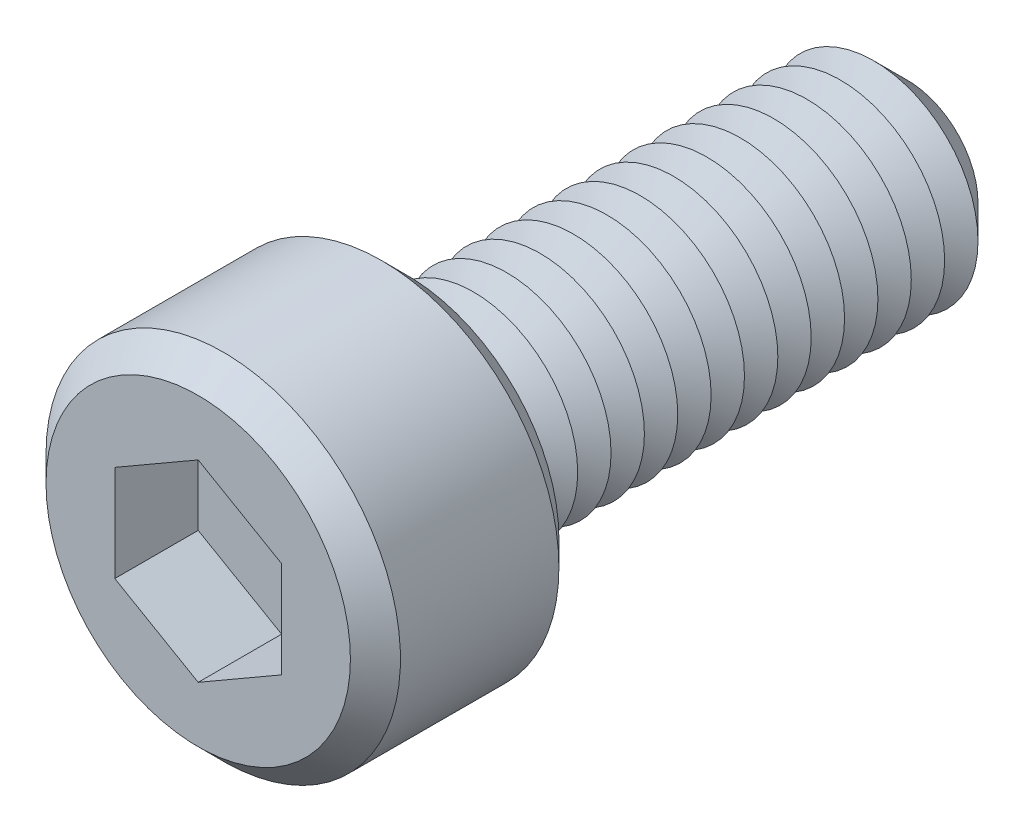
ISO-10303-21;
HEADER;
FILE_DESCRIPTION(('STEP AP214'),'2;1');
FILE_NAME('part.step','',(''),(''),'','','');
FILE_SCHEMA(('AUTOMOTIVE_DESIGN { 1 0 10303 214 1 1 1 1 }'));
ENDSEC;
DATA;
#1=APPLICATION_CONTEXT('core data for automotive mechanical design processes');
#2=APPLICATION_PROTOCOL_DEFINITION('international standard','automotive_design',2000,#1);
#3=PRODUCT_CONTEXT('',#1,'mechanical');
#4=PRODUCT('Part','Part','',(#3));
#5=PRODUCT_RELATED_PRODUCT_CATEGORY('part','',(#4));
#6=PRODUCT_DEFINITION_FORMATION('','',#4);
#7=PRODUCT_DEFINITION_CONTEXT('part definition',#1,'design');
#8=PRODUCT_DEFINITION('design','',#6,#7);
#9=PRODUCT_DEFINITION_SHAPE('','',#8);
#10=(LENGTH_UNIT() NAMED_UNIT(*) SI_UNIT(.MILLI.,.METRE.));
#11=(NAMED_UNIT(*) PLANE_ANGLE_UNIT() SI_UNIT($,.RADIAN.));
#12=(NAMED_UNIT(*) SI_UNIT($,.STERADIAN.) SOLID_ANGLE_UNIT());
#13=UNCERTAINTY_MEASURE_WITH_UNIT(LENGTH_MEASURE(1.E-05),#10,'distance_accuracy_value','');
#14=(GEOMETRIC_REPRESENTATION_CONTEXT(3) GLOBAL_UNCERTAINTY_ASSIGNED_CONTEXT((#13)) GLOBAL_UNIT_ASSIGNED_CONTEXT((#10,
#11,#12)) REPRESENTATION_CONTEXT('',''));
#15=CARTESIAN_POINT('',(0.,0.,0.));
#16=DIRECTION('',(0.,0.,1.));
#17=DIRECTION('',(1.,0.,0.));
#18=AXIS2_PLACEMENT_3D('',#15,#16,#17);
#19=CARTESIAN_POINT('',(0.,0.,5.));
#20=DIRECTION('',(0.,0.,-1.));
#21=DIRECTION('',(-1.,0.,0.));
#22=AXIS2_PLACEMENT_3D('',#19,#20,#21);
#23=CYLINDRICAL_SURFACE('',#22,4.25);
#24=CARTESIAN_POINT('',(0.,0.,0.600000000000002));
#25=DIRECTION('',(0.,0.,1.));
#26=DIRECTION('',(1.,0.,0.));
#27=AXIS2_PLACEMENT_3D('',#24,#25,#26);
#28=CIRCLE('',#27,4.25);
#29=CARTESIAN_POINT('',(4.25,0.,0.600000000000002));
#30=VERTEX_POINT('',#29);
#31=EDGE_CURVE('E288',#30,#30,#28,.T.);
#32=ORIENTED_EDGE('',*,*,#31,.T.);
#33=EDGE_LOOP('',(#32));
#34=FACE_BOUND('',#33,.T.);
#35=CARTESIAN_POINT('',(0.,0.,4.39999999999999));
#36=DIRECTION('',(0.,0.,1.));
#37=DIRECTION('',(1.,0.,0.));
#38=AXIS2_PLACEMENT_3D('',#35,#36,#37);
#39=CIRCLE('',#38,4.25);
#40=CARTESIAN_POINT('',(-4.25,0.,4.39999999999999));
#41=VERTEX_POINT('',#40);
#42=EDGE_CURVE('E284',#41,#41,#39,.F.);
#43=ORIENTED_EDGE('',*,*,#42,.T.);
#44=EDGE_LOOP('',(#43));
#45=FACE_BOUND('',#44,.T.);
#46=ADVANCED_FACE('F39',(#34,#45),#23,.T.);
#47=CARTESIAN_POINT('',(0.,0.,5.));
#48=DIRECTION('',(0.,0.,1.));
#49=DIRECTION('',(1.,0.,0.));
#50=AXIS2_PLACEMENT_3D('',#47,#48,#49);
#51=PLANE('',#50);
#52=CARTESIAN_POINT('',(0.,0.,5.));
#53=DIRECTION('',(0.,0.,1.));
#54=DIRECTION('',(1.,0.,0.));
#55=AXIS2_PLACEMENT_3D('',#52,#53,#54);
#56=CIRCLE('',#55,3.65);
#57=CARTESIAN_POINT('',(-3.65,0.,5.));
#58=VERTEX_POINT('',#57);
#59=EDGE_CURVE('E11',#58,#58,#56,.T.);
#60=ORIENTED_EDGE('',*,*,#59,.T.);
#61=EDGE_LOOP('',(#60));
#62=FACE_BOUND('',#61,.T.);
#63=DIRECTION('',(-0.866025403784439,0.5,0.));
#64=VECTOR('',#63,1.);
#65=CARTESIAN_POINT('',(2.,1.15470053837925,5.));
#66=LINE('',#65,#64);
#67=CARTESIAN_POINT('',(2.,1.15470053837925,5.));
#68=VERTEX_POINT('',#67);
#69=CARTESIAN_POINT('',(0.,2.3094010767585,5.));
#70=VERTEX_POINT('',#69);
#71=EDGE_CURVE('E55',#68,#70,#66,.T.);
#72=ORIENTED_EDGE('',*,*,#71,.F.);
#73=DIRECTION('',(0.,1.,0.));
#74=VECTOR('',#73,1.);
#75=CARTESIAN_POINT('',(2.,-1.15470053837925,5.));
#76=LINE('',#75,#74);
#77=CARTESIAN_POINT('',(2.,-1.15470053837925,5.));
#78=VERTEX_POINT('',#77);
#79=EDGE_CURVE('E150',#78,#68,#76,.T.);
#80=ORIENTED_EDGE('',*,*,#79,.F.);
#81=DIRECTION('',(0.866025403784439,0.5,0.));
#82=VECTOR('',#81,1.);
#83=CARTESIAN_POINT('',(0.,-2.3094010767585,5.));
#84=LINE('',#83,#82);
#85=CARTESIAN_POINT('',(0.,-2.3094010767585,5.));
#86=VERTEX_POINT('',#85);
#87=EDGE_CURVE('E147',#86,#78,#84,.T.);
#88=ORIENTED_EDGE('',*,*,#87,.F.);
#89=DIRECTION('',(0.866025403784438,-0.5,0.));
#90=VECTOR('',#89,1.);
#91=CARTESIAN_POINT('',(-2.,-1.15470053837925,5.));
#92=LINE('',#91,#90);
#93=CARTESIAN_POINT('',(-2.,-1.15470053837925,5.));
#94=VERTEX_POINT('',#93);
#95=EDGE_CURVE('E103',#94,#86,#92,.T.);
#96=ORIENTED_EDGE('',*,*,#95,.F.);
#97=DIRECTION('',(0.,-1.,0.));
#98=VECTOR('',#97,1.);
#99=CARTESIAN_POINT('',(-2.,1.15470053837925,5.));
#100=LINE('',#99,#98);
#101=CARTESIAN_POINT('',(-2.,1.15470053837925,5.));
#102=VERTEX_POINT('',#101);
#103=EDGE_CURVE('E141',#102,#94,#100,.T.);
#104=ORIENTED_EDGE('',*,*,#103,.F.);
#105=DIRECTION('',(-0.866025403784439,-0.5,0.));
#106=VECTOR('',#105,1.);
#107=CARTESIAN_POINT('',(0.,2.3094010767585,5.));
#108=LINE('',#107,#106);
#109=EDGE_CURVE('E136',#70,#102,#108,.T.);
#110=ORIENTED_EDGE('',*,*,#109,.F.);
#111=EDGE_LOOP('',(#72,#80,#88,#96,#104,#110));
#112=FACE_BOUND('',#111,.T.);
#113=ADVANCED_FACE('F306',(#62,#112),#51,.T.);
#114=CARTESIAN_POINT('',(0.,0.,0.));
#115=DIRECTION('',(0.,0.,1.));
#116=DIRECTION('',(1.,0.,0.));
#117=AXIS2_PLACEMENT_3D('',#114,#115,#116);
#118=PLANE('',#117);
#119=CARTESIAN_POINT('',(0.,0.,0.));
#120=DIRECTION('',(0.,0.,1.));
#121=DIRECTION('',(1.,0.,0.));
#122=AXIS2_PLACEMENT_3D('',#119,#120,#121);
#123=CIRCLE('',#122,3.65);
#124=CARTESIAN_POINT('',(3.65,0.,0.));
#125=VERTEX_POINT('',#124);
#126=EDGE_CURVE('E48',#125,#125,#123,.F.);
#127=ORIENTED_EDGE('',*,*,#126,.T.);
#128=EDGE_LOOP('',(#127));
#129=FACE_BOUND('',#128,.T.);
#130=CARTESIAN_POINT('',(0.,0.,0.));
#131=DIRECTION('',(0.,0.,1.));
#132=DIRECTION('',(1.,0.,0.));
#133=AXIS2_PLACEMENT_3D('',#130,#131,#132);
#134=CIRCLE('',#133,2.5);
#135=CARTESIAN_POINT('',(2.5,0.,0.));
#136=VERTEX_POINT('',#135);
#137=EDGE_CURVE('E276',#136,#136,#134,.T.);
#138=ORIENTED_EDGE('',*,*,#137,.T.);
#139=EDGE_LOOP('',(#138));
#140=FACE_BOUND('',#139,.T.);
#141=ADVANCED_FACE('F295',(#129,#140),#118,.F.);
#142=CARTESIAN_POINT('',(0.,0.,0.));
#143=DIRECTION('',(0.,0.,1.));
#144=DIRECTION('',(1.,0.,0.));
#145=AXIS2_PLACEMENT_3D('',#142,#143,#144);
#146=CONICAL_SURFACE('',#145,2.5,1.0471975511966);
#147=CARTESIAN_POINT('',(0.,0.,-0.4));
#148=DIRECTION('',(0.,0.,1.));
#149=DIRECTION('',(1.,0.,0.));
#150=AXIS2_PLACEMENT_3D('',#147,#148,#149);
#151=CIRCLE('',#150,1.80717967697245);
#152=CARTESIAN_POINT('',(1.80717967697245,0.,-0.4));
#153=VERTEX_POINT('',#152);
#154=EDGE_CURVE('E272',#153,#153,#151,.T.);
#155=ORIENTED_EDGE('',*,*,#154,.T.);
#156=EDGE_LOOP('',(#155));
#157=FACE_BOUND('',#156,.T.);
#158=ORIENTED_EDGE('',*,*,#137,.F.);
#159=EDGE_LOOP('',(#158));
#160=FACE_BOUND('',#159,.T.);
#161=ADVANCED_FACE('F468',(#157,#160),#146,.T.);
#162=CARTESIAN_POINT('',(0.,0.,-0.4));
#163=DIRECTION('',(0.,0.,-1.));
#164=DIRECTION('',(-1.,0.,0.));
#165=AXIS2_PLACEMENT_3D('',#162,#163,#164);
#166=CONICAL_SURFACE('',#165,1.80717967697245,1.0471975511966);
#167=CARTESIAN_POINT('',(0.,0.,-0.8));
#168=DIRECTION('',(0.,0.,1.));
#169=DIRECTION('',(1.,0.,0.));
#170=AXIS2_PLACEMENT_3D('',#167,#168,#169);
#171=CIRCLE('',#170,2.5);
#172=CARTESIAN_POINT('',(2.5,0.,-0.8));
#173=VERTEX_POINT('',#172);
#174=EDGE_CURVE('E268',#173,#173,#171,.T.);
#175=ORIENTED_EDGE('',*,*,#174,.T.);
#176=EDGE_LOOP('',(#175));
#177=FACE_BOUND('',#176,.T.);
#178=ORIENTED_EDGE('',*,*,#154,.F.);
#179=EDGE_LOOP('',(#178));
#180=FACE_BOUND('',#179,.T.);
#181=ADVANCED_FACE('F464',(#177,#180),#166,.T.);
#182=CARTESIAN_POINT('',(0.,0.,-0.8));
#183=DIRECTION('',(0.,0.,1.));
#184=DIRECTION('',(1.,0.,0.));
#185=AXIS2_PLACEMENT_3D('',#182,#183,#184);
#186=CONICAL_SURFACE('',#185,2.5,1.0471975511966);
#187=CARTESIAN_POINT('',(0.,0.,-1.2));
#188=DIRECTION('',(0.,0.,1.));
#189=DIRECTION('',(1.,0.,0.));
#190=AXIS2_PLACEMENT_3D('',#187,#188,#189);
#191=CIRCLE('',#190,1.80717967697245);
#192=CARTESIAN_POINT('',(1.80717967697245,0.,-1.2));
#193=VERTEX_POINT('',#192);
#194=EDGE_CURVE('E264',#193,#193,#191,.T.);
#195=ORIENTED_EDGE('',*,*,#194,.T.);
#196=EDGE_LOOP('',(#195));
#197=FACE_BOUND('',#196,.T.);
#198=ORIENTED_EDGE('',*,*,#174,.F.);
#199=EDGE_LOOP('',(#198));
#200=FACE_BOUND('',#199,.T.);
#201=ADVANCED_FACE('F460',(#197,#200),#186,.T.);
#202=CARTESIAN_POINT('',(0.,0.,-1.2));
#203=DIRECTION('',(0.,0.,-1.));
#204=DIRECTION('',(-1.,0.,0.));
#205=AXIS2_PLACEMENT_3D('',#202,#203,#204);
#206=CONICAL_SURFACE('',#205,1.80717967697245,1.0471975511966);
#207=CARTESIAN_POINT('',(0.,0.,-1.6));
#208=DIRECTION('',(0.,0.,1.));
#209=DIRECTION('',(1.,0.,0.));
#210=AXIS2_PLACEMENT_3D('',#207,#208,#209);
#211=CIRCLE('',#210,2.5);
#212=CARTESIAN_POINT('',(2.5,0.,-1.6));
#213=VERTEX_POINT('',#212);
#214=EDGE_CURVE('E260',#213,#213,#211,.T.);
#215=ORIENTED_EDGE('',*,*,#214,.T.);
#216=EDGE_LOOP('',(#215));
#217=FACE_BOUND('',#216,.T.);
#218=ORIENTED_EDGE('',*,*,#194,.F.);
#219=EDGE_LOOP('',(#218));
#220=FACE_BOUND('',#219,.T.);
#221=ADVANCED_FACE('F456',(#217,#220),#206,.T.);
#222=CARTESIAN_POINT('',(0.,0.,-1.6));
#223=DIRECTION('',(0.,0.,1.));
#224=DIRECTION('',(1.,0.,0.));
#225=AXIS2_PLACEMENT_3D('',#222,#223,#224);
#226=CONICAL_SURFACE('',#225,2.5,1.0471975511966);
#227=CARTESIAN_POINT('',(0.,0.,-2.));
#228=DIRECTION('',(0.,0.,1.));
#229=DIRECTION('',(1.,0.,0.));
#230=AXIS2_PLACEMENT_3D('',#227,#228,#229);
#231=CIRCLE('',#230,1.80717967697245);
#232=CARTESIAN_POINT('',(1.80717967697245,0.,-2.));
#233=VERTEX_POINT('',#232);
#234=EDGE_CURVE('E256',#233,#233,#231,.T.);
#235=ORIENTED_EDGE('',*,*,#234,.T.);
#236=EDGE_LOOP('',(#235));
#237=FACE_BOUND('',#236,.T.);
#238=ORIENTED_EDGE('',*,*,#214,.F.);
#239=EDGE_LOOP('',(#238));
#240=FACE_BOUND('',#239,.T.);
#241=ADVANCED_FACE('F452',(#237,#240),#226,.T.);
#242=CARTESIAN_POINT('',(0.,0.,-2.));
#243=DIRECTION('',(0.,0.,-1.));
#244=DIRECTION('',(-1.,0.,0.));
#245=AXIS2_PLACEMENT_3D('',#242,#243,#244);
#246=CONICAL_SURFACE('',#245,1.80717967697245,1.0471975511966);
#247=CARTESIAN_POINT('',(0.,0.,-2.4));
#248=DIRECTION('',(0.,0.,1.));
#249=DIRECTION('',(1.,0.,0.));
#250=AXIS2_PLACEMENT_3D('',#247,#248,#249);
#251=CIRCLE('',#250,2.5);
#252=CARTESIAN_POINT('',(2.5,0.,-2.4));
#253=VERTEX_POINT('',#252);
#254=EDGE_CURVE('E252',#253,#253,#251,.T.);
#255=ORIENTED_EDGE('',*,*,#254,.T.);
#256=EDGE_LOOP('',(#255));
#257=FACE_BOUND('',#256,.T.);
#258=ORIENTED_EDGE('',*,*,#234,.F.);
#259=EDGE_LOOP('',(#258));
#260=FACE_BOUND('',#259,.T.);
#261=ADVANCED_FACE('F448',(#257,#260),#246,.T.);
#262=CARTESIAN_POINT('',(0.,0.,-2.4));
#263=DIRECTION('',(0.,0.,1.));
#264=DIRECTION('',(1.,0.,0.));
#265=AXIS2_PLACEMENT_3D('',#262,#263,#264);
#266=CONICAL_SURFACE('',#265,2.5,1.0471975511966);
#267=CARTESIAN_POINT('',(0.,0.,-2.8));
#268=DIRECTION('',(0.,0.,1.));
#269=DIRECTION('',(1.,0.,0.));
#270=AXIS2_PLACEMENT_3D('',#267,#268,#269);
#271=CIRCLE('',#270,1.80717967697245);
#272=CARTESIAN_POINT('',(1.80717967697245,0.,-2.8));
#273=VERTEX_POINT('',#272);
#274=EDGE_CURVE('E248',#273,#273,#271,.T.);
#275=ORIENTED_EDGE('',*,*,#274,.T.);
#276=EDGE_LOOP('',(#275));
#277=FACE_BOUND('',#276,.T.);
#278=ORIENTED_EDGE('',*,*,#254,.F.);
#279=EDGE_LOOP('',(#278));
#280=FACE_BOUND('',#279,.T.);
#281=ADVANCED_FACE('F444',(#277,#280),#266,.T.);
#282=CARTESIAN_POINT('',(0.,0.,-2.8));
#283=DIRECTION('',(0.,0.,-1.));
#284=DIRECTION('',(-1.,0.,0.));
#285=AXIS2_PLACEMENT_3D('',#282,#283,#284);
#286=CONICAL_SURFACE('',#285,1.80717967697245,1.0471975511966);
#287=CARTESIAN_POINT('',(0.,0.,-3.2));
#288=DIRECTION('',(0.,0.,1.));
#289=DIRECTION('',(1.,0.,0.));
#290=AXIS2_PLACEMENT_3D('',#287,#288,#289);
#291=CIRCLE('',#290,2.5);
#292=CARTESIAN_POINT('',(2.5,0.,-3.2));
#293=VERTEX_POINT('',#292);
#294=EDGE_CURVE('E244',#293,#293,#291,.T.);
#295=ORIENTED_EDGE('',*,*,#294,.T.);
#296=EDGE_LOOP('',(#295));
#297=FACE_BOUND('',#296,.T.);
#298=ORIENTED_EDGE('',*,*,#274,.F.);
#299=EDGE_LOOP('',(#298));
#300=FACE_BOUND('',#299,.T.);
#301=ADVANCED_FACE('F440',(#297,#300),#286,.T.);
#302=CARTESIAN_POINT('',(0.,0.,-3.2));
#303=DIRECTION('',(0.,0.,1.));
#304=DIRECTION('',(1.,0.,0.));
#305=AXIS2_PLACEMENT_3D('',#302,#303,#304);
#306=CONICAL_SURFACE('',#305,2.5,1.0471975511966);
#307=CARTESIAN_POINT('',(0.,0.,-3.6));
#308=DIRECTION('',(0.,0.,1.));
#309=DIRECTION('',(1.,0.,0.));
#310=AXIS2_PLACEMENT_3D('',#307,#308,#309);
#311=CIRCLE('',#310,1.80717967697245);
#312=CARTESIAN_POINT('',(1.80717967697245,0.,-3.6));
#313=VERTEX_POINT('',#312);
#314=EDGE_CURVE('E240',#313,#313,#311,.T.);
#315=ORIENTED_EDGE('',*,*,#314,.T.);
#316=EDGE_LOOP('',(#315));
#317=FACE_BOUND('',#316,.T.);
#318=ORIENTED_EDGE('',*,*,#294,.F.);
#319=EDGE_LOOP('',(#318));
#320=FACE_BOUND('',#319,.T.);
#321=ADVANCED_FACE('F436',(#317,#320),#306,.T.);
#322=CARTESIAN_POINT('',(0.,0.,-3.6));
#323=DIRECTION('',(0.,0.,-1.));
#324=DIRECTION('',(-1.,0.,0.));
#325=AXIS2_PLACEMENT_3D('',#322,#323,#324);
#326=CONICAL_SURFACE('',#325,1.80717967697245,1.0471975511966);
#327=CARTESIAN_POINT('',(0.,0.,-4.));
#328=DIRECTION('',(0.,0.,1.));
#329=DIRECTION('',(1.,0.,0.));
#330=AXIS2_PLACEMENT_3D('',#327,#328,#329);
#331=CIRCLE('',#330,2.5);
#332=CARTESIAN_POINT('',(2.5,0.,-4.));
#333=VERTEX_POINT('',#332);
#334=EDGE_CURVE('E236',#333,#333,#331,.T.);
#335=ORIENTED_EDGE('',*,*,#334,.T.);
#336=EDGE_LOOP('',(#335));
#337=FACE_BOUND('',#336,.T.);
#338=ORIENTED_EDGE('',*,*,#314,.F.);
#339=EDGE_LOOP('',(#338));
#340=FACE_BOUND('',#339,.T.);
#341=ADVANCED_FACE('F432',(#337,#340),#326,.T.);
#342=CARTESIAN_POINT('',(0.,0.,-4.));
#343=DIRECTION('',(0.,0.,1.));
#344=DIRECTION('',(1.,0.,0.));
#345=AXIS2_PLACEMENT_3D('',#342,#343,#344);
#346=CONICAL_SURFACE('',#345,2.5,1.0471975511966);
#347=CARTESIAN_POINT('',(0.,0.,-4.4));
#348=DIRECTION('',(0.,0.,1.));
#349=DIRECTION('',(1.,0.,0.));
#350=AXIS2_PLACEMENT_3D('',#347,#348,#349);
#351=CIRCLE('',#350,1.80717967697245);
#352=CARTESIAN_POINT('',(1.80717967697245,0.,-4.4));
#353=VERTEX_POINT('',#352);
#354=EDGE_CURVE('E232',#353,#353,#351,.T.);
#355=ORIENTED_EDGE('',*,*,#354,.T.);
#356=EDGE_LOOP('',(#355));
#357=FACE_BOUND('',#356,.T.);
#358=ORIENTED_EDGE('',*,*,#334,.F.);
#359=EDGE_LOOP('',(#358));
#360=FACE_BOUND('',#359,.T.);
#361=ADVANCED_FACE('F428',(#357,#360),#346,.T.);
#362=CARTESIAN_POINT('',(0.,0.,-4.4));
#363=DIRECTION('',(0.,0.,-1.));
#364=DIRECTION('',(-1.,0.,0.));
#365=AXIS2_PLACEMENT_3D('',#362,#363,#364);
#366=CONICAL_SURFACE('',#365,1.80717967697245,1.0471975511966);
#367=CARTESIAN_POINT('',(0.,0.,-4.8));
#368=DIRECTION('',(0.,0.,1.));
#369=DIRECTION('',(1.,0.,0.));
#370=AXIS2_PLACEMENT_3D('',#367,#368,#369);
#371=CIRCLE('',#370,2.5);
#372=CARTESIAN_POINT('',(2.5,0.,-4.8));
#373=VERTEX_POINT('',#372);
#374=EDGE_CURVE('E228',#373,#373,#371,.T.);
#375=ORIENTED_EDGE('',*,*,#374,.T.);
#376=EDGE_LOOP('',(#375));
#377=FACE_BOUND('',#376,.T.);
#378=ORIENTED_EDGE('',*,*,#354,.F.);
#379=EDGE_LOOP('',(#378));
#380=FACE_BOUND('',#379,.T.);
#381=ADVANCED_FACE('F424',(#377,#380),#366,.T.);
#382=CARTESIAN_POINT('',(0.,0.,-4.8));
#383=DIRECTION('',(0.,0.,1.));
#384=DIRECTION('',(1.,0.,0.));
#385=AXIS2_PLACEMENT_3D('',#382,#383,#384);
#386=CONICAL_SURFACE('',#385,2.5,1.0471975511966);
#387=CARTESIAN_POINT('',(0.,0.,-5.2));
#388=DIRECTION('',(0.,0.,1.));
#389=DIRECTION('',(1.,0.,0.));
#390=AXIS2_PLACEMENT_3D('',#387,#388,#389);
#391=CIRCLE('',#390,1.80717967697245);
#392=CARTESIAN_POINT('',(1.80717967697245,0.,-5.2));
#393=VERTEX_POINT('',#392);
#394=EDGE_CURVE('E224',#393,#393,#391,.T.);
#395=ORIENTED_EDGE('',*,*,#394,.T.);
#396=EDGE_LOOP('',(#395));
#397=FACE_BOUND('',#396,.T.);
#398=ORIENTED_EDGE('',*,*,#374,.F.);
#399=EDGE_LOOP('',(#398));
#400=FACE_BOUND('',#399,.T.);
#401=ADVANCED_FACE('F420',(#397,#400),#386,.T.);
#402=CARTESIAN_POINT('',(0.,0.,-5.2));
#403=DIRECTION('',(0.,0.,-1.));
#404=DIRECTION('',(-1.,0.,0.));
#405=AXIS2_PLACEMENT_3D('',#402,#403,#404);
#406=CONICAL_SURFACE('',#405,1.80717967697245,1.0471975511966);
#407=CARTESIAN_POINT('',(0.,0.,-5.6));
#408=DIRECTION('',(0.,0.,1.));
#409=DIRECTION('',(1.,0.,0.));
#410=AXIS2_PLACEMENT_3D('',#407,#408,#409);
#411=CIRCLE('',#410,2.5);
#412=CARTESIAN_POINT('',(2.5,0.,-5.6));
#413=VERTEX_POINT('',#412);
#414=EDGE_CURVE('E220',#413,#413,#411,.T.);
#415=ORIENTED_EDGE('',*,*,#414,.T.);
#416=EDGE_LOOP('',(#415));
#417=FACE_BOUND('',#416,.T.);
#418=ORIENTED_EDGE('',*,*,#394,.F.);
#419=EDGE_LOOP('',(#418));
#420=FACE_BOUND('',#419,.T.);
#421=ADVANCED_FACE('F416',(#417,#420),#406,.T.);
#422=CARTESIAN_POINT('',(0.,0.,-5.6));
#423=DIRECTION('',(0.,0.,1.));
#424=DIRECTION('',(1.,0.,0.));
#425=AXIS2_PLACEMENT_3D('',#422,#423,#424);
#426=CONICAL_SURFACE('',#425,2.5,1.0471975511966);
#427=CARTESIAN_POINT('',(0.,0.,-6.));
#428=DIRECTION('',(0.,0.,1.));
#429=DIRECTION('',(1.,0.,0.));
#430=AXIS2_PLACEMENT_3D('',#427,#428,#429);
#431=CIRCLE('',#430,1.80717967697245);
#432=CARTESIAN_POINT('',(1.80717967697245,0.,-6.));
#433=VERTEX_POINT('',#432);
#434=EDGE_CURVE('E216',#433,#433,#431,.T.);
#435=ORIENTED_EDGE('',*,*,#434,.T.);
#436=EDGE_LOOP('',(#435));
#437=FACE_BOUND('',#436,.T.);
#438=ORIENTED_EDGE('',*,*,#414,.F.);
#439=EDGE_LOOP('',(#438));
#440=FACE_BOUND('',#439,.T.);
#441=ADVANCED_FACE('F412',(#437,#440),#426,.T.);
#442=CARTESIAN_POINT('',(0.,0.,-6.));
#443=DIRECTION('',(0.,0.,-1.));
#444=DIRECTION('',(-1.,0.,0.));
#445=AXIS2_PLACEMENT_3D('',#442,#443,#444);
#446=CONICAL_SURFACE('',#445,1.80717967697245,1.0471975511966);
#447=CARTESIAN_POINT('',(0.,0.,-6.4));
#448=DIRECTION('',(0.,0.,1.));
#449=DIRECTION('',(1.,0.,0.));
#450=AXIS2_PLACEMENT_3D('',#447,#448,#449);
#451=CIRCLE('',#450,2.5);
#452=CARTESIAN_POINT('',(2.5,0.,-6.4));
#453=VERTEX_POINT('',#452);
#454=EDGE_CURVE('E212',#453,#453,#451,.T.);
#455=ORIENTED_EDGE('',*,*,#454,.T.);
#456=EDGE_LOOP('',(#455));
#457=FACE_BOUND('',#456,.T.);
#458=ORIENTED_EDGE('',*,*,#434,.F.);
#459=EDGE_LOOP('',(#458));
#460=FACE_BOUND('',#459,.T.);
#461=ADVANCED_FACE('F408',(#457,#460),#446,.T.);
#462=CARTESIAN_POINT('',(0.,0.,-6.4));
#463=DIRECTION('',(0.,0.,1.));
#464=DIRECTION('',(1.,0.,0.));
#465=AXIS2_PLACEMENT_3D('',#462,#463,#464);
#466=CONICAL_SURFACE('',#465,2.5,1.0471975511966);
#467=CARTESIAN_POINT('',(0.,0.,-6.8));
#468=DIRECTION('',(0.,0.,1.));
#469=DIRECTION('',(1.,0.,0.));
#470=AXIS2_PLACEMENT_3D('',#467,#468,#469);
#471=CIRCLE('',#470,1.80717967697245);
#472=CARTESIAN_POINT('',(1.80717967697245,0.,-6.8));
#473=VERTEX_POINT('',#472);
#474=EDGE_CURVE('E208',#473,#473,#471,.T.);
#475=ORIENTED_EDGE('',*,*,#474,.T.);
#476=EDGE_LOOP('',(#475));
#477=FACE_BOUND('',#476,.T.);
#478=ORIENTED_EDGE('',*,*,#454,.F.);
#479=EDGE_LOOP('',(#478));
#480=FACE_BOUND('',#479,.T.);
#481=ADVANCED_FACE('F404',(#477,#480),#466,.T.);
#482=CARTESIAN_POINT('',(0.,0.,-6.8));
#483=DIRECTION('',(0.,0.,-1.));
#484=DIRECTION('',(-1.,0.,0.));
#485=AXIS2_PLACEMENT_3D('',#482,#483,#484);
#486=CONICAL_SURFACE('',#485,1.80717967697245,1.0471975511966);
#487=CARTESIAN_POINT('',(0.,0.,-7.2));
#488=DIRECTION('',(0.,0.,1.));
#489=DIRECTION('',(1.,0.,0.));
#490=AXIS2_PLACEMENT_3D('',#487,#488,#489);
#491=CIRCLE('',#490,2.5);
#492=CARTESIAN_POINT('',(2.5,0.,-7.2));
#493=VERTEX_POINT('',#492);
#494=EDGE_CURVE('E204',#493,#493,#491,.T.);
#495=ORIENTED_EDGE('',*,*,#494,.T.);
#496=EDGE_LOOP('',(#495));
#497=FACE_BOUND('',#496,.T.);
#498=ORIENTED_EDGE('',*,*,#474,.F.);
#499=EDGE_LOOP('',(#498));
#500=FACE_BOUND('',#499,.T.);
#501=ADVANCED_FACE('F400',(#497,#500),#486,.T.);
#502=CARTESIAN_POINT('',(0.,0.,-7.2));
#503=DIRECTION('',(0.,0.,1.));
#504=DIRECTION('',(1.,0.,0.));
#505=AXIS2_PLACEMENT_3D('',#502,#503,#504);
#506=CONICAL_SURFACE('',#505,2.5,1.0471975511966);
#507=CARTESIAN_POINT('',(0.,0.,-7.6));
#508=DIRECTION('',(0.,0.,1.));
#509=DIRECTION('',(1.,0.,0.));
#510=AXIS2_PLACEMENT_3D('',#507,#508,#509);
#511=CIRCLE('',#510,1.80717967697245);
#512=CARTESIAN_POINT('',(1.80717967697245,0.,-7.6));
#513=VERTEX_POINT('',#512);
#514=EDGE_CURVE('E200',#513,#513,#511,.T.);
#515=ORIENTED_EDGE('',*,*,#514,.T.);
#516=EDGE_LOOP('',(#515));
#517=FACE_BOUND('',#516,.T.);
#518=ORIENTED_EDGE('',*,*,#494,.F.);
#519=EDGE_LOOP('',(#518));
#520=FACE_BOUND('',#519,.T.);
#521=ADVANCED_FACE('F396',(#517,#520),#506,.T.);
#522=CARTESIAN_POINT('',(0.,0.,-7.6));
#523=DIRECTION('',(0.,0.,-1.));
#524=DIRECTION('',(-1.,0.,0.));
#525=AXIS2_PLACEMENT_3D('',#522,#523,#524);
#526=CONICAL_SURFACE('',#525,1.80717967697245,1.0471975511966);
#527=CARTESIAN_POINT('',(0.,0.,-8.));
#528=DIRECTION('',(0.,0.,1.));
#529=DIRECTION('',(1.,0.,0.));
#530=AXIS2_PLACEMENT_3D('',#527,#528,#529);
#531=CIRCLE('',#530,2.5);
#532=CARTESIAN_POINT('',(2.5,0.,-8.));
#533=VERTEX_POINT('',#532);
#534=EDGE_CURVE('E196',#533,#533,#531,.T.);
#535=ORIENTED_EDGE('',*,*,#534,.T.);
#536=EDGE_LOOP('',(#535));
#537=FACE_BOUND('',#536,.T.);
#538=ORIENTED_EDGE('',*,*,#514,.F.);
#539=EDGE_LOOP('',(#538));
#540=FACE_BOUND('',#539,.T.);
#541=ADVANCED_FACE('F392',(#537,#540),#526,.T.);
#542=CARTESIAN_POINT('',(0.,0.,-8.));
#543=DIRECTION('',(0.,0.,1.));
#544=DIRECTION('',(1.,0.,0.));
#545=AXIS2_PLACEMENT_3D('',#542,#543,#544);
#546=CONICAL_SURFACE('',#545,2.5,1.0471975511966);
#547=CARTESIAN_POINT('',(0.,0.,-8.4));
#548=DIRECTION('',(0.,0.,1.));
#549=DIRECTION('',(1.,0.,0.));
#550=AXIS2_PLACEMENT_3D('',#547,#548,#549);
#551=CIRCLE('',#550,1.80717967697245);
#552=CARTESIAN_POINT('',(1.80717967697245,0.,-8.4));
#553=VERTEX_POINT('',#552);
#554=EDGE_CURVE('E193',#553,#553,#551,.T.);
#555=ORIENTED_EDGE('',*,*,#554,.T.);
#556=EDGE_LOOP('',(#555));
#557=FACE_BOUND('',#556,.T.);
#558=ORIENTED_EDGE('',*,*,#534,.F.);
#559=EDGE_LOOP('',(#558));
#560=FACE_BOUND('',#559,.T.);
#561=ADVANCED_FACE('F388',(#557,#560),#546,.T.);
#562=CARTESIAN_POINT('',(0.,0.,-8.4));
#563=DIRECTION('',(0.,0.,-1.));
#564=DIRECTION('',(-1.,0.,0.));
#565=AXIS2_PLACEMENT_3D('',#562,#563,#564);
#566=CONICAL_SURFACE('',#565,1.80717967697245,1.0471975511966);
#567=CARTESIAN_POINT('',(0.,0.,-8.8));
#568=DIRECTION('',(0.,0.,1.));
#569=DIRECTION('',(1.,0.,0.));
#570=AXIS2_PLACEMENT_3D('',#567,#568,#569);
#571=CIRCLE('',#570,2.5);
#572=CARTESIAN_POINT('',(2.5,0.,-8.8));
#573=VERTEX_POINT('',#572);
#574=EDGE_CURVE('E189',#573,#573,#571,.T.);
#575=ORIENTED_EDGE('',*,*,#574,.T.);
#576=EDGE_LOOP('',(#575));
#577=FACE_BOUND('',#576,.T.);
#578=ORIENTED_EDGE('',*,*,#554,.F.);
#579=EDGE_LOOP('',(#578));
#580=FACE_BOUND('',#579,.T.);
#581=ADVANCED_FACE('F384',(#577,#580),#566,.T.);
#582=CARTESIAN_POINT('',(0.,0.,-8.8));
#583=DIRECTION('',(0.,0.,1.));
#584=DIRECTION('',(1.,0.,0.));
#585=AXIS2_PLACEMENT_3D('',#582,#583,#584);
#586=CONICAL_SURFACE('',#585,2.5,1.0471975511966);
#587=CARTESIAN_POINT('',(0.,0.,-9.2));
#588=DIRECTION('',(0.,0.,1.));
#589=DIRECTION('',(1.,0.,0.));
#590=AXIS2_PLACEMENT_3D('',#587,#588,#589);
#591=CIRCLE('',#590,1.80717967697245);
#592=CARTESIAN_POINT('',(1.80717967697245,0.,-9.2));
#593=VERTEX_POINT('',#592);
#594=EDGE_CURVE('E185',#593,#593,#591,.T.);
#595=ORIENTED_EDGE('',*,*,#594,.T.);
#596=EDGE_LOOP('',(#595));
#597=FACE_BOUND('',#596,.T.);
#598=ORIENTED_EDGE('',*,*,#574,.F.);
#599=EDGE_LOOP('',(#598));
#600=FACE_BOUND('',#599,.T.);
#601=ADVANCED_FACE('F380',(#597,#600),#586,.T.);
#602=CARTESIAN_POINT('',(0.,0.,-9.2));
#603=DIRECTION('',(0.,0.,-1.));
#604=DIRECTION('',(-1.,0.,0.));
#605=AXIS2_PLACEMENT_3D('',#602,#603,#604);
#606=CONICAL_SURFACE('',#605,1.80717967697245,1.0471975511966);
#607=CARTESIAN_POINT('',(0.,0.,-9.6));
#608=DIRECTION('',(0.,0.,1.));
#609=DIRECTION('',(1.,0.,0.));
#610=AXIS2_PLACEMENT_3D('',#607,#608,#609);
#611=CIRCLE('',#610,2.5);
#612=CARTESIAN_POINT('',(2.5,0.,-9.6));
#613=VERTEX_POINT('',#612);
#614=EDGE_CURVE('E181',#613,#613,#611,.T.);
#615=ORIENTED_EDGE('',*,*,#614,.T.);
#616=EDGE_LOOP('',(#615));
#617=FACE_BOUND('',#616,.T.);
#618=ORIENTED_EDGE('',*,*,#594,.F.);
#619=EDGE_LOOP('',(#618));
#620=FACE_BOUND('',#619,.T.);
#621=ADVANCED_FACE('F376',(#617,#620),#606,.T.);
#622=CARTESIAN_POINT('',(0.,0.,-9.6));
#623=DIRECTION('',(0.,0.,1.));
#624=DIRECTION('',(1.,0.,0.));
#625=AXIS2_PLACEMENT_3D('',#622,#623,#624);
#626=CONICAL_SURFACE('',#625,2.5,1.0471975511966);
#627=CARTESIAN_POINT('',(0.,0.,-10.));
#628=DIRECTION('',(0.,0.,1.));
#629=DIRECTION('',(1.,0.,0.));
#630=AXIS2_PLACEMENT_3D('',#627,#628,#629);
#631=CIRCLE('',#630,1.80717967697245);
#632=CARTESIAN_POINT('',(1.80717967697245,0.,-10.));
#633=VERTEX_POINT('',#632);
#634=EDGE_CURVE('E177',#633,#633,#631,.T.);
#635=ORIENTED_EDGE('',*,*,#634,.T.);
#636=EDGE_LOOP('',(#635));
#637=FACE_BOUND('',#636,.T.);
#638=ORIENTED_EDGE('',*,*,#614,.F.);
#639=EDGE_LOOP('',(#638));
#640=FACE_BOUND('',#639,.T.);
#641=ADVANCED_FACE('F372',(#637,#640),#626,.T.);
#642=CARTESIAN_POINT('',(0.,0.,-10.));
#643=DIRECTION('',(0.,0.,-1.));
#644=DIRECTION('',(-1.,0.,0.));
#645=AXIS2_PLACEMENT_3D('',#642,#643,#644);
#646=CONICAL_SURFACE('',#645,1.80717967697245,1.0471975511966);
#647=CARTESIAN_POINT('',(0.,0.,-10.4));
#648=DIRECTION('',(0.,0.,1.));
#649=DIRECTION('',(1.,0.,0.));
#650=AXIS2_PLACEMENT_3D('',#647,#648,#649);
#651=CIRCLE('',#650,2.5);
#652=CARTESIAN_POINT('',(2.5,0.,-10.4));
#653=VERTEX_POINT('',#652);
#654=EDGE_CURVE('E173',#653,#653,#651,.T.);
#655=ORIENTED_EDGE('',*,*,#654,.T.);
#656=EDGE_LOOP('',(#655));
#657=FACE_BOUND('',#656,.T.);
#658=ORIENTED_EDGE('',*,*,#634,.F.);
#659=EDGE_LOOP('',(#658));
#660=FACE_BOUND('',#659,.T.);
#661=ADVANCED_FACE('F368',(#657,#660),#646,.T.);
#662=CARTESIAN_POINT('',(0.,0.,-10.4));
#663=DIRECTION('',(0.,0.,1.));
#664=DIRECTION('',(1.,0.,0.));
#665=AXIS2_PLACEMENT_3D('',#662,#663,#664);
#666=CONICAL_SURFACE('',#665,2.5,1.0471975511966);
#667=CARTESIAN_POINT('',(0.,0.,-10.8));
#668=DIRECTION('',(0.,0.,1.));
#669=DIRECTION('',(1.,0.,0.));
#670=AXIS2_PLACEMENT_3D('',#667,#668,#669);
#671=CIRCLE('',#670,1.80717967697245);
#672=CARTESIAN_POINT('',(1.80717967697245,0.,-10.8));
#673=VERTEX_POINT('',#672);
#674=EDGE_CURVE('E169',#673,#673,#671,.T.);
#675=ORIENTED_EDGE('',*,*,#674,.T.);
#676=EDGE_LOOP('',(#675));
#677=FACE_BOUND('',#676,.T.);
#678=ORIENTED_EDGE('',*,*,#654,.F.);
#679=EDGE_LOOP('',(#678));
#680=FACE_BOUND('',#679,.T.);
#681=ADVANCED_FACE('F364',(#677,#680),#666,.T.);
#682=CARTESIAN_POINT('',(0.,0.,-10.8));
#683=DIRECTION('',(0.,0.,-1.));
#684=DIRECTION('',(-1.,0.,0.));
#685=AXIS2_PLACEMENT_3D('',#682,#683,#684);
#686=CONICAL_SURFACE('',#685,1.80717967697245,1.0471975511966);
#687=CARTESIAN_POINT('',(0.,0.,-11.2));
#688=DIRECTION('',(0.,0.,1.));
#689=DIRECTION('',(1.,0.,0.));
#690=AXIS2_PLACEMENT_3D('',#687,#688,#689);
#691=CIRCLE('',#690,2.5);
#692=CARTESIAN_POINT('',(2.5,0.,-11.2));
#693=VERTEX_POINT('',#692);
#694=EDGE_CURVE('E156',#693,#693,#691,.T.);
#695=ORIENTED_EDGE('',*,*,#694,.T.);
#696=EDGE_LOOP('',(#695));
#697=FACE_BOUND('',#696,.T.);
#698=ORIENTED_EDGE('',*,*,#674,.F.);
#699=EDGE_LOOP('',(#698));
#700=FACE_BOUND('',#699,.T.);
#701=ADVANCED_FACE('F360',(#697,#700),#686,.T.);
#702=CARTESIAN_POINT('',(0.,0.,-12.));
#703=DIRECTION('',(0.,0.,-1.));
#704=DIRECTION('',(-1.,0.,0.));
#705=AXIS2_PLACEMENT_3D('',#702,#703,#704);
#706=PLANE('',#705);
#707=CARTESIAN_POINT('',(0.,0.,-12.));
#708=DIRECTION('',(0.,0.,-1.));
#709=DIRECTION('',(-1.,0.,0.));
#710=AXIS2_PLACEMENT_3D('',#707,#708,#709);
#711=CIRCLE('',#710,0.65);
#712=CARTESIAN_POINT('',(-0.65,0.,-12.));
#713=VERTEX_POINT('',#712);
#714=EDGE_CURVE('E137',#713,#713,#711,.F.);
#715=ORIENTED_EDGE('',*,*,#714,.T.);
#716=EDGE_LOOP('',(#715));
#717=FACE_BOUND('',#716,.T.);
#718=CARTESIAN_POINT('',(0.,0.,-12.));
#719=DIRECTION('',(0.,0.,-1.));
#720=DIRECTION('',(-1.,0.,0.));
#721=AXIS2_PLACEMENT_3D('',#718,#719,#720);
#722=CIRCLE('',#721,1.7);
#723=CARTESIAN_POINT('',(1.7,0.,-12.));
#724=VERTEX_POINT('',#723);
#725=EDGE_CURVE('E280',#724,#724,#722,.T.);
#726=ORIENTED_EDGE('',*,*,#725,.T.);
#727=EDGE_LOOP('',(#726));
#728=FACE_BOUND('',#727,.T.);
#729=ADVANCED_FACE('F363',(#717,#728),#706,.T.);
#730=CARTESIAN_POINT('',(0.,0.,-12.));
#731=DIRECTION('',(0.,0.,1.));
#732=DIRECTION('',(1.,0.,0.));
#733=AXIS2_PLACEMENT_3D('',#730,#731,#732);
#734=CONICAL_SURFACE('',#733,1.7,0.785398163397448);
#735=CARTESIAN_POINT('',(2.5,0.,-11.2));
#736=CARTESIAN_POINT('',(2.49166666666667,0.,-11.2083333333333));
#737=CARTESIAN_POINT('',(2.48333333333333,0.,-11.2166666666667));
#738=CARTESIAN_POINT('',(2.46666666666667,0.,-11.2333333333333));
#739=CARTESIAN_POINT('',(2.45833333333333,0.,-11.2416666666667));
#740=CARTESIAN_POINT('',(2.44166666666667,0.,-11.2583333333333));
#741=CARTESIAN_POINT('',(2.43333333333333,0.,-11.2666666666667));
#742=CARTESIAN_POINT('',(2.41666666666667,0.,-11.2833333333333));
#743=CARTESIAN_POINT('',(2.40833333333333,0.,-11.2916666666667));
#744=CARTESIAN_POINT('',(2.39166666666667,0.,-11.3083333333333));
#745=CARTESIAN_POINT('',(2.38333333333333,0.,-11.3166666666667));
#746=CARTESIAN_POINT('',(2.36666666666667,0.,-11.3333333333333));
#747=CARTESIAN_POINT('',(2.35833333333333,0.,-11.3416666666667));
#748=CARTESIAN_POINT('',(2.34166666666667,0.,-11.3583333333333));
#749=CARTESIAN_POINT('',(2.33333333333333,0.,-11.3666666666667));
#750=CARTESIAN_POINT('',(2.31666666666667,0.,-11.3833333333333));
#751=CARTESIAN_POINT('',(2.30833333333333,0.,-11.3916666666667));
#752=CARTESIAN_POINT('',(2.29166666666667,0.,-11.4083333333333));
#753=CARTESIAN_POINT('',(2.28333333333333,0.,-11.4166666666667));
#754=CARTESIAN_POINT('',(2.26666666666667,0.,-11.4333333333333));
#755=CARTESIAN_POINT('',(2.25833333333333,0.,-11.4416666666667));
#756=CARTESIAN_POINT('',(2.24166666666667,0.,-11.4583333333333));
#757=CARTESIAN_POINT('',(2.23333333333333,0.,-11.4666666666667));
#758=CARTESIAN_POINT('',(2.21666666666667,0.,-11.4833333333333));
#759=CARTESIAN_POINT('',(2.20833333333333,0.,-11.4916666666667));
#760=CARTESIAN_POINT('',(2.19166666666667,0.,-11.5083333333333));
#761=CARTESIAN_POINT('',(2.18333333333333,0.,-11.5166666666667));
#762=CARTESIAN_POINT('',(2.16666666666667,0.,-11.5333333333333));
#763=CARTESIAN_POINT('',(2.15833333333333,0.,-11.5416666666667));
#764=CARTESIAN_POINT('',(2.14166666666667,0.,-11.5583333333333));
#765=CARTESIAN_POINT('',(2.13333333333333,0.,-11.5666666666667));
#766=CARTESIAN_POINT('',(2.11666666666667,0.,-11.5833333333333));
#767=CARTESIAN_POINT('',(2.10833333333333,0.,-11.5916666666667));
#768=CARTESIAN_POINT('',(2.09166666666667,0.,-11.6083333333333));
#769=CARTESIAN_POINT('',(2.08333333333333,0.,-11.6166666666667));
#770=CARTESIAN_POINT('',(2.06666666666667,0.,-11.6333333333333));
#771=CARTESIAN_POINT('',(2.05833333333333,0.,-11.6416666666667));
#772=CARTESIAN_POINT('',(2.04166666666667,0.,-11.6583333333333));
#773=CARTESIAN_POINT('',(2.03333333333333,0.,-11.6666666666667));
#774=CARTESIAN_POINT('',(2.01666666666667,0.,-11.6833333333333));
#775=CARTESIAN_POINT('',(2.00833333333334,0.,-11.6916666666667));
#776=CARTESIAN_POINT('',(1.99166666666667,0.,-11.7083333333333));
#777=CARTESIAN_POINT('',(1.98333333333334,0.,-11.7166666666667));
#778=CARTESIAN_POINT('',(1.96666666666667,0.,-11.7333333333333));
#779=CARTESIAN_POINT('',(1.95833333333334,0.,-11.7416666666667));
#780=CARTESIAN_POINT('',(1.94166666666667,0.,-11.7583333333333));
#781=CARTESIAN_POINT('',(1.93333333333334,0.,-11.7666666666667));
#782=CARTESIAN_POINT('',(1.91666666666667,0.,-11.7833333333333));
#783=CARTESIAN_POINT('',(1.90833333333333,0.,-11.7916666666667));
#784=CARTESIAN_POINT('',(1.89166666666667,0.,-11.8083333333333));
#785=CARTESIAN_POINT('',(1.88333333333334,0.,-11.8166666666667));
#786=CARTESIAN_POINT('',(1.86666666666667,0.,-11.8333333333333));
#787=CARTESIAN_POINT('',(1.85833333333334,0.,-11.8416666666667));
#788=CARTESIAN_POINT('',(1.84166666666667,0.,-11.8583333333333));
#789=CARTESIAN_POINT('',(1.83333333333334,0.,-11.8666666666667));
#790=CARTESIAN_POINT('',(1.81666666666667,0.,-11.8833333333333));
#791=CARTESIAN_POINT('',(1.80833333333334,0.,-11.8916666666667));
#792=CARTESIAN_POINT('',(1.79166666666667,0.,-11.9083333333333));
#793=CARTESIAN_POINT('',(1.78333333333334,0.,-11.9166666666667));
#794=CARTESIAN_POINT('',(1.76666666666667,0.,-11.9333333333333));
#795=CARTESIAN_POINT('',(1.75833333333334,0.,-11.9416666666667));
#796=CARTESIAN_POINT('',(1.74166666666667,0.,-11.9583333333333));
#797=CARTESIAN_POINT('',(1.73333333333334,0.,-11.9666666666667));
#798=CARTESIAN_POINT('',(1.71666666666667,0.,-11.9833333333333));
#799=CARTESIAN_POINT('',(1.70833333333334,0.,-11.9916666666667));
#800=CARTESIAN_POINT('',(1.7,0.,-12.));
#801=B_SPLINE_CURVE_WITH_KNOTS('',3,(#735,#736,#737,#738,#739,#740,#741,#742,#743,#744,#745,
#746,#747,#748,#749,#750,#751,#752,#753,#754,#755,#756,#757,#758,#759,#760,#761,#762,#763,#764,
#765,#766,#767,#768,#769,#770,#771,#772,#773,#774,#775,#776,#777,#778,#779,#780,#781,#782,#783,
#784,#785,#786,#787,#788,#789,#790,#791,#792,#793,#794,#795,#796,#797,#798,#799,#800),
.UNSPECIFIED.,.F.,.F.,(4,2,2,2,2,2,2,2,2,2,2,2,2,2,2,2,2,2,2,2,2,2,2,2,2,2,2,2,2,2,2,2,4),(0.,
0.0353553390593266,0.0707106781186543,0.106066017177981,0.141421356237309,0.176776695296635,
0.212132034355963,0.24748737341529,0.282842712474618,0.318198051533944,0.353553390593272,
0.388908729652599,0.424264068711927,0.459619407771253,0.494974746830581,0.530330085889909,
0.565685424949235,0.601040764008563,0.63639610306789,0.671751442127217,0.707106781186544,
0.742462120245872,0.777817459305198,0.813172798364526,0.848528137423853,0.883883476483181,
0.919238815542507,0.954594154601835,0.989949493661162,1.02530483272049,1.06066017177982,
1.09601551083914,1.13137084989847),.UNSPECIFIED.);
#802=EDGE_CURVE('BSEAM359',#693,#724,#801,.T.);
#803=ORIENTED_EDGE('',*,*,#694,.F.);
#804=ORIENTED_EDGE('',*,*,#725,.F.);
#805=ORIENTED_EDGE('',*,*,#802,.T.);
#806=ORIENTED_EDGE('',*,*,#802,.F.);
#807=EDGE_LOOP('',(#803,#805,#804,#806));
#808=FACE_BOUND('',#807,.T.);
#809=ADVANCED_FACE('F359',(#808),#734,.T.);
#810=CARTESIAN_POINT('',(2.,1.15470053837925,3.));
#811=DIRECTION('',(0.5,0.866025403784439,0.));
#812=DIRECTION('',(-0.866025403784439,0.5,0.));
#813=AXIS2_PLACEMENT_3D('',#810,#811,#812);
#814=PLANE('',#813);
#815=ORIENTED_EDGE('',*,*,#71,.T.);
#816=DIRECTION('',(0.,0.,1.));
#817=VECTOR('',#816,1.);
#818=CARTESIAN_POINT('',(0.,2.3094010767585,3.));
#819=LINE('',#818,#817);
#820=CARTESIAN_POINT('',(0.,2.3094010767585,3.));
#821=VERTEX_POINT('',#820);
#822=EDGE_CURVE('E85',#821,#70,#819,.T.);
#823=ORIENTED_EDGE('',*,*,#822,.F.);
#824=DIRECTION('',(-0.866025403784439,0.5,0.));
#825=VECTOR('',#824,1.);
#826=CARTESIAN_POINT('',(2.,1.15470053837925,3.));
#827=LINE('',#826,#825);
#828=CARTESIAN_POINT('',(2.,1.15470053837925,3.));
#829=VERTEX_POINT('',#828);
#830=EDGE_CURVE('E153',#829,#821,#827,.T.);
#831=ORIENTED_EDGE('',*,*,#830,.F.);
#832=DIRECTION('',(0.,0.,1.));
#833=VECTOR('',#832,1.);
#834=CARTESIAN_POINT('',(2.,1.15470053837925,3.));
#835=LINE('',#834,#833);
#836=EDGE_CURVE('E63',#829,#68,#835,.T.);
#837=ORIENTED_EDGE('',*,*,#836,.T.);
#838=EDGE_LOOP('',(#815,#823,#831,#837));
#839=FACE_BOUND('',#838,.T.);
#840=ADVANCED_FACE('F349',(#839),#814,.F.);
#841=CARTESIAN_POINT('',(2.,-1.15470053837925,3.));
#842=DIRECTION('',(1.,0.,0.));
#843=DIRECTION('',(0.,0.,-1.));
#844=AXIS2_PLACEMENT_3D('',#841,#842,#843);
#845=PLANE('',#844);
#846=ORIENTED_EDGE('',*,*,#79,.T.);
#847=ORIENTED_EDGE('',*,*,#836,.F.);
#848=DIRECTION('',(0.,1.,0.));
#849=VECTOR('',#848,1.);
#850=CARTESIAN_POINT('',(2.,-1.15470053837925,3.));
#851=LINE('',#850,#849);
#852=CARTESIAN_POINT('',(2.,-1.15470053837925,3.));
#853=VERTEX_POINT('',#852);
#854=EDGE_CURVE('E117',#853,#829,#851,.T.);
#855=ORIENTED_EDGE('',*,*,#854,.F.);
#856=DIRECTION('',(0.,0.,1.));
#857=VECTOR('',#856,1.);
#858=CARTESIAN_POINT('',(2.,-1.15470053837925,3.));
#859=LINE('',#858,#857);
#860=EDGE_CURVE('E108',#853,#78,#859,.T.);
#861=ORIENTED_EDGE('',*,*,#860,.T.);
#862=EDGE_LOOP('',(#846,#847,#855,#861));
#863=FACE_BOUND('',#862,.T.);
#864=ADVANCED_FACE('F346',(#863),#845,.F.);
#865=CARTESIAN_POINT('',(0.,-2.3094010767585,3.));
#866=DIRECTION('',(0.5,-0.866025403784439,0.));
#867=DIRECTION('',(0.866025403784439,0.5,0.));
#868=AXIS2_PLACEMENT_3D('',#865,#866,#867);
#869=PLANE('',#868);
#870=ORIENTED_EDGE('',*,*,#87,.T.);
#871=ORIENTED_EDGE('',*,*,#860,.F.);
#872=DIRECTION('',(0.866025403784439,0.5,0.));
#873=VECTOR('',#872,1.);
#874=CARTESIAN_POINT('',(0.,-2.3094010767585,3.));
#875=LINE('',#874,#873);
#876=CARTESIAN_POINT('',(0.,-2.3094010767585,3.));
#877=VERTEX_POINT('',#876);
#878=EDGE_CURVE('E112',#877,#853,#875,.T.);
#879=ORIENTED_EDGE('',*,*,#878,.F.);
#880=DIRECTION('',(0.,0.,1.));
#881=VECTOR('',#880,1.);
#882=CARTESIAN_POINT('',(0.,-2.3094010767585,3.));
#883=LINE('',#882,#881);
#884=EDGE_CURVE('E96',#877,#86,#883,.T.);
#885=ORIENTED_EDGE('',*,*,#884,.T.);
#886=EDGE_LOOP('',(#870,#871,#879,#885));
#887=FACE_BOUND('',#886,.T.);
#888=ADVANCED_FACE('F113',(#887),#869,.F.);
#889=CARTESIAN_POINT('',(-2.,-1.15470053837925,3.));
#890=DIRECTION('',(-0.5,-0.866025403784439,0.));
#891=DIRECTION('',(0.866025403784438,-0.5,0.));
#892=AXIS2_PLACEMENT_3D('',#889,#890,#891);
#893=PLANE('',#892);
#894=ORIENTED_EDGE('',*,*,#95,.T.);
#895=ORIENTED_EDGE('',*,*,#884,.F.);
#896=DIRECTION('',(0.866025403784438,-0.5,0.));
#897=VECTOR('',#896,1.);
#898=CARTESIAN_POINT('',(-2.,-1.15470053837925,3.));
#899=LINE('',#898,#897);
#900=CARTESIAN_POINT('',(-2.,-1.15470053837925,3.));
#901=VERTEX_POINT('',#900);
#902=EDGE_CURVE('E100',#901,#877,#899,.T.);
#903=ORIENTED_EDGE('',*,*,#902,.F.);
#904=DIRECTION('',(0.,0.,1.));
#905=VECTOR('',#904,1.);
#906=CARTESIAN_POINT('',(-2.,-1.15470053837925,3.));
#907=LINE('',#906,#905);
#908=EDGE_CURVE('E109',#901,#94,#907,.T.);
#909=ORIENTED_EDGE('',*,*,#908,.T.);
#910=EDGE_LOOP('',(#894,#895,#903,#909));
#911=FACE_BOUND('',#910,.T.);
#912=ADVANCED_FACE('F98',(#911),#893,.F.);
#913=CARTESIAN_POINT('',(-2.,1.15470053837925,3.));
#914=DIRECTION('',(-1.,0.,0.));
#915=DIRECTION('',(0.,-1.,0.));
#916=AXIS2_PLACEMENT_3D('',#913,#914,#915);
#917=PLANE('',#916);
#918=ORIENTED_EDGE('',*,*,#103,.T.);
#919=ORIENTED_EDGE('',*,*,#908,.F.);
#920=DIRECTION('',(0.,-1.,0.));
#921=VECTOR('',#920,1.);
#922=CARTESIAN_POINT('',(-2.,1.15470053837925,3.));
#923=LINE('',#922,#921);
#924=CARTESIAN_POINT('',(-2.,1.15470053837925,3.));
#925=VERTEX_POINT('',#924);
#926=EDGE_CURVE('E123',#925,#901,#923,.T.);
#927=ORIENTED_EDGE('',*,*,#926,.F.);
#928=DIRECTION('',(0.,0.,1.));
#929=VECTOR('',#928,1.);
#930=CARTESIAN_POINT('',(-2.,1.15470053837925,3.));
#931=LINE('',#930,#929);
#932=EDGE_CURVE('E161',#925,#102,#931,.T.);
#933=ORIENTED_EDGE('',*,*,#932,.T.);
#934=EDGE_LOOP('',(#918,#919,#927,#933));
#935=FACE_BOUND('',#934,.T.);
#936=ADVANCED_FACE('F343',(#935),#917,.F.);
#937=CARTESIAN_POINT('',(0.,2.3094010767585,3.));
#938=DIRECTION('',(-0.5,0.866025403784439,0.));
#939=DIRECTION('',(-0.866025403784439,-0.5,0.));
#940=AXIS2_PLACEMENT_3D('',#937,#938,#939);
#941=PLANE('',#940);
#942=ORIENTED_EDGE('',*,*,#109,.T.);
#943=ORIENTED_EDGE('',*,*,#932,.F.);
#944=DIRECTION('',(-0.866025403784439,-0.5,0.));
#945=VECTOR('',#944,1.);
#946=CARTESIAN_POINT('',(0.,2.3094010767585,3.));
#947=LINE('',#946,#945);
#948=EDGE_CURVE('E129',#821,#925,#947,.T.);
#949=ORIENTED_EDGE('',*,*,#948,.F.);
#950=ORIENTED_EDGE('',*,*,#822,.T.);
#951=EDGE_LOOP('',(#942,#943,#949,#950));
#952=FACE_BOUND('',#951,.T.);
#953=ADVANCED_FACE('F321',(#952),#941,.F.);
#954=CARTESIAN_POINT('',(0.,0.,3.));
#955=DIRECTION('',(0.,0.,1.));
#956=DIRECTION('',(1.,0.,0.));
#957=AXIS2_PLACEMENT_3D('',#954,#955,#956);
#958=PLANE('',#957);
#959=CARTESIAN_POINT('',(0.,0.,3.));
#960=DIRECTION('',(0.,0.,1.));
#961=DIRECTION('',(1.,0.,0.));
#962=AXIS2_PLACEMENT_3D('',#959,#960,#961);
#963=CIRCLE('',#962,0.65);
#964=CARTESIAN_POINT('',(0.65,0.,3.));
#965=VERTEX_POINT('',#964);
#966=EDGE_CURVE('E329',#965,#965,#963,.T.);
#967=ORIENTED_EDGE('',*,*,#966,.F.);
#968=EDGE_LOOP('',(#967));
#969=FACE_BOUND('',#968,.T.);
#970=ORIENTED_EDGE('',*,*,#830,.T.);
#971=ORIENTED_EDGE('',*,*,#948,.T.);
#972=ORIENTED_EDGE('',*,*,#926,.T.);
#973=ORIENTED_EDGE('',*,*,#902,.T.);
#974=ORIENTED_EDGE('',*,*,#878,.T.);
#975=ORIENTED_EDGE('',*,*,#854,.T.);
#976=EDGE_LOOP('',(#970,#971,#972,#973,#974,#975));
#977=FACE_BOUND('',#976,.T.);
#978=ADVANCED_FACE('F120',(#969,#977),#958,.T.);
#979=CARTESIAN_POINT('',(0.,0.,-13.838477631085));
#980=DIRECTION('',(0.,0.,1.));
#981=DIRECTION('',(1.,0.,0.));
#982=AXIS2_PLACEMENT_3D('',#979,#980,#981);
#983=CYLINDRICAL_SURFACE('',#982,0.65);
#984=ORIENTED_EDGE('',*,*,#966,.T.);
#985=EDGE_LOOP('',(#984));
#986=FACE_BOUND('',#985,.T.);
#987=ORIENTED_EDGE('',*,*,#714,.F.);
#988=EDGE_LOOP('',(#987));
#989=FACE_BOUND('',#988,.T.);
#990=ADVANCED_FACE('F301',(#986,#989),#983,.F.);
#991=CARTESIAN_POINT('',(0.,0.,0.600000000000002));
#992=DIRECTION('',(0.,0.,1.));
#993=DIRECTION('',(1.,0.,0.));
#994=AXIS2_PLACEMENT_3D('',#991,#992,#993);
#995=CONICAL_SURFACE('',#994,4.25,0.78539816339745);
#996=ORIENTED_EDGE('',*,*,#126,.F.);
#997=EDGE_LOOP('',(#996));
#998=FACE_BOUND('',#997,.T.);
#999=ORIENTED_EDGE('',*,*,#31,.F.);
#1000=EDGE_LOOP('',(#999));
#1001=FACE_BOUND('',#1000,.T.);
#1002=ADVANCED_FACE('F298',(#998,#1001),#995,.T.);
#1003=CARTESIAN_POINT('',(0.,0.,5.));
#1004=DIRECTION('',(0.,0.,-1.));
#1005=DIRECTION('',(-1.,0.,0.));
#1006=AXIS2_PLACEMENT_3D('',#1003,#1004,#1005);
#1007=CONICAL_SURFACE('',#1006,3.65,0.785398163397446);
#1008=CARTESIAN_POINT('',(-4.25,0.,4.39999999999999));
#1009=CARTESIAN_POINT('',(-4.24375,0.,4.40624999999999));
#1010=CARTESIAN_POINT('',(-4.2375,0.,4.41249999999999));
#1011=CARTESIAN_POINT('',(-4.225,0.,4.42499999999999));
#1012=CARTESIAN_POINT('',(-4.21875,0.,4.43124999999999));
#1013=CARTESIAN_POINT('',(-4.20625,0.,4.44374999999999));
#1014=CARTESIAN_POINT('',(-4.2,0.,4.44999999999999));
#1015=CARTESIAN_POINT('',(-4.1875,0.,4.46249999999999));
#1016=CARTESIAN_POINT('',(-4.18125,0.,4.46874999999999));
#1017=CARTESIAN_POINT('',(-4.16875,0.,4.48124999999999));
#1018=CARTESIAN_POINT('',(-4.1625,0.,4.48749999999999));
#1019=CARTESIAN_POINT('',(-4.15,0.,4.49999999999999));
#1020=CARTESIAN_POINT('',(-4.14375,0.,4.50624999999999));
#1021=CARTESIAN_POINT('',(-4.13125,0.,4.51875));
#1022=CARTESIAN_POINT('',(-4.125,0.,4.525));
#1023=CARTESIAN_POINT('',(-4.1125,0.,4.5375));
#1024=CARTESIAN_POINT('',(-4.10625,0.,4.54374999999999));
#1025=CARTESIAN_POINT('',(-4.09375,0.,4.55625));
#1026=CARTESIAN_POINT('',(-4.0875,0.,4.5625));
#1027=CARTESIAN_POINT('',(-4.075,0.,4.575));
#1028=CARTESIAN_POINT('',(-4.06875,0.,4.58125));
#1029=CARTESIAN_POINT('',(-4.05625,0.,4.59375));
#1030=CARTESIAN_POINT('',(-4.05,0.,4.6));
#1031=CARTESIAN_POINT('',(-4.0375,0.,4.6125));
#1032=CARTESIAN_POINT('',(-4.03125,0.,4.61875));
#1033=CARTESIAN_POINT('',(-4.01875,0.,4.63125));
#1034=CARTESIAN_POINT('',(-4.0125,0.,4.6375));
#1035=CARTESIAN_POINT('',(-4.,0.,4.65));
#1036=CARTESIAN_POINT('',(-3.99375,0.,4.65625));
#1037=CARTESIAN_POINT('',(-3.98125,0.,4.66875));
#1038=CARTESIAN_POINT('',(-3.975,0.,4.675));
#1039=CARTESIAN_POINT('',(-3.9625,0.,4.6875));
#1040=CARTESIAN_POINT('',(-3.95625,0.,4.69375));
#1041=CARTESIAN_POINT('',(-3.94375,0.,4.70625));
#1042=CARTESIAN_POINT('',(-3.9375,0.,4.7125));
#1043=CARTESIAN_POINT('',(-3.925,0.,4.725));
#1044=CARTESIAN_POINT('',(-3.91875,0.,4.73125));
#1045=CARTESIAN_POINT('',(-3.90625,0.,4.74375));
#1046=CARTESIAN_POINT('',(-3.9,0.,4.75));
#1047=CARTESIAN_POINT('',(-3.8875,0.,4.7625));
#1048=CARTESIAN_POINT('',(-3.88125,0.,4.76875));
#1049=CARTESIAN_POINT('',(-3.86875,0.,4.78125));
#1050=CARTESIAN_POINT('',(-3.8625,0.,4.7875));
#1051=CARTESIAN_POINT('',(-3.85,0.,4.8));
#1052=CARTESIAN_POINT('',(-3.84375,0.,4.80625));
#1053=CARTESIAN_POINT('',(-3.83125,0.,4.81875));
#1054=CARTESIAN_POINT('',(-3.825,0.,4.825));
#1055=CARTESIAN_POINT('',(-3.8125,0.,4.8375));
#1056=CARTESIAN_POINT('',(-3.80625,0.,4.84375));
#1057=CARTESIAN_POINT('',(-3.79375,0.,4.85625));
#1058=CARTESIAN_POINT('',(-3.7875,0.,4.8625));
#1059=CARTESIAN_POINT('',(-3.775,0.,4.875));
#1060=CARTESIAN_POINT('',(-3.76875,0.,4.88125));
#1061=CARTESIAN_POINT('',(-3.75625,0.,4.89375));
#1062=CARTESIAN_POINT('',(-3.75,0.,4.9));
#1063=CARTESIAN_POINT('',(-3.7375,0.,4.9125));
#1064=CARTESIAN_POINT('',(-3.73125,0.,4.91875));
#1065=CARTESIAN_POINT('',(-3.71875,0.,4.93125));
#1066=CARTESIAN_POINT('',(-3.7125,0.,4.9375));
#1067=CARTESIAN_POINT('',(-3.7,0.,4.95));
#1068=CARTESIAN_POINT('',(-3.69375,0.,4.95625));
#1069=CARTESIAN_POINT('',(-3.68125,0.,4.96875));
#1070=CARTESIAN_POINT('',(-3.675,0.,4.975));
#1071=CARTESIAN_POINT('',(-3.6625,0.,4.9875));
#1072=CARTESIAN_POINT('',(-3.65625,0.,4.99375));
#1073=CARTESIAN_POINT('',(-3.65,0.,5.));
#1074=B_SPLINE_CURVE_WITH_KNOTS('',3,(#1008,#1009,#1010,#1011,#1012,#1013,#1014,#1015,#1016,
#1017,#1018,#1019,#1020,#1021,#1022,#1023,#1024,#1025,#1026,#1027,#1028,#1029,#1030,#1031,#1032,
#1033,#1034,#1035,#1036,#1037,#1038,#1039,#1040,#1041,#1042,#1043,#1044,#1045,#1046,#1047,#1048,
#1049,#1050,#1051,#1052,#1053,#1054,#1055,#1056,#1057,#1058,#1059,#1060,#1061,#1062,#1063,#1064,
#1065,#1066,#1067,#1068,#1069,#1070,#1071,#1072,#1073),.UNSPECIFIED.,.F.,.F.,(4,2,2,2,2,2,2,2,2,
2,2,2,2,2,2,2,2,2,2,2,2,2,2,2,2,2,2,2,2,2,2,2,4),(0.,0.0265165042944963,0.053033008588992,
0.0795495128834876,0.106066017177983,0.132582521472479,0.159099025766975,0.185615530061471,
0.212132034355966,0.238648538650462,0.265165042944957,0.291681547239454,0.318198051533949,
0.344714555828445,0.371231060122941,0.397747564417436,0.424264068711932,0.450780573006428,
0.477297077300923,0.50381358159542,0.530330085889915,0.556846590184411,0.583363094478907,
0.609879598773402,0.636396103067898,0.662912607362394,0.68942911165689,0.715945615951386,
0.742462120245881,0.768978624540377,0.795495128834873,0.822011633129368,0.848528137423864),.UNSPECIFIED.);
#1075=EDGE_CURVE('BSEAM41',#41,#58,#1074,.T.);
#1076=ORIENTED_EDGE('',*,*,#42,.F.);
#1077=ORIENTED_EDGE('',*,*,#59,.F.);
#1078=ORIENTED_EDGE('',*,*,#1075,.T.);
#1079=ORIENTED_EDGE('',*,*,#1075,.F.);
#1080=EDGE_LOOP('',(#1076,#1078,#1077,#1079));
#1081=FACE_BOUND('',#1080,.T.);
#1082=ADVANCED_FACE('F41',(#1081),#1007,.T.);
#1083=CLOSED_SHELL('',(#46,#113,#141,#161,#181,#201,#221,#241,#261,#281,#301,#321,#341,#361,
#381,#401,#421,#441,#461,#481,#501,#521,#541,#561,#581,#601,#621,#641,#661,#681,#701,#729,#809,
#840,#864,#888,#912,#936,#953,#978,#990,#1002,#1082));
#1084=MANIFOLD_SOLID_BREP('B2',#1083);
#1085=ADVANCED_BREP_SHAPE_REPRESENTATION('',(#18,#1084),#14);
#1086=SHAPE_DEFINITION_REPRESENTATION(#9,#1085);
ENDSEC;
END-ISO-10303-21;
